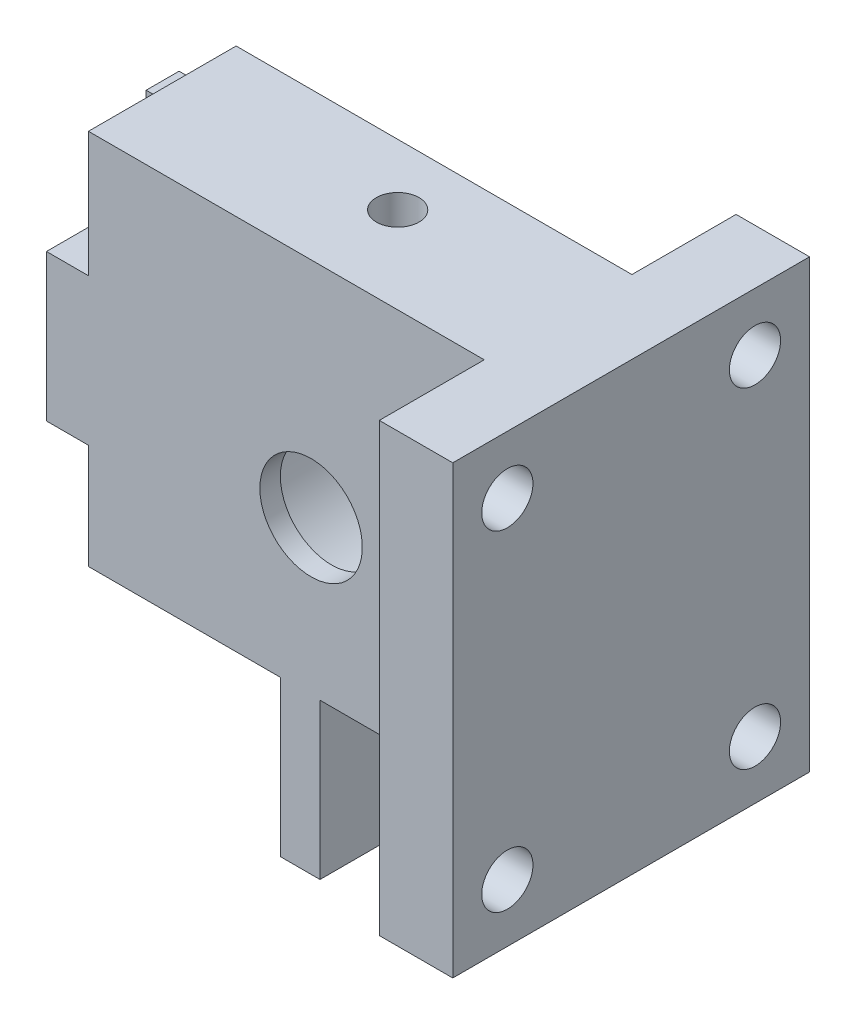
ISO-10303-21;
HEADER;
FILE_DESCRIPTION(('STEP AP214'),'2;1');
FILE_NAME('part.step','',(''),(''),'','','');
FILE_SCHEMA(('AUTOMOTIVE_DESIGN { 1 0 10303 214 1 1 1 1 }'));
ENDSEC;
DATA;
#1=APPLICATION_CONTEXT('core data for automotive mechanical design processes');
#2=APPLICATION_PROTOCOL_DEFINITION('international standard','automotive_design',2000,#1);
#3=PRODUCT_CONTEXT('',#1,'mechanical');
#4=PRODUCT('Part','Part','',(#3));
#5=PRODUCT_RELATED_PRODUCT_CATEGORY('part','',(#4));
#6=PRODUCT_DEFINITION_FORMATION('','',#4);
#7=PRODUCT_DEFINITION_CONTEXT('part definition',#1,'design');
#8=PRODUCT_DEFINITION('design','',#6,#7);
#9=PRODUCT_DEFINITION_SHAPE('','',#8);
#10=(LENGTH_UNIT() NAMED_UNIT(*) SI_UNIT(.MILLI.,.METRE.));
#11=(NAMED_UNIT(*) PLANE_ANGLE_UNIT() SI_UNIT($,.RADIAN.));
#12=(NAMED_UNIT(*) SI_UNIT($,.STERADIAN.) SOLID_ANGLE_UNIT());
#13=UNCERTAINTY_MEASURE_WITH_UNIT(LENGTH_MEASURE(1.E-05),#10,'distance_accuracy_value','');
#14=(GEOMETRIC_REPRESENTATION_CONTEXT(3) GLOBAL_UNCERTAINTY_ASSIGNED_CONTEXT((#13)) GLOBAL_UNIT_ASSIGNED_CONTEXT((#10,
#11,#12)) REPRESENTATION_CONTEXT('',''));
#15=CARTESIAN_POINT('',(0.,0.,0.));
#16=DIRECTION('',(0.,0.,1.));
#17=DIRECTION('',(1.,0.,0.));
#18=AXIS2_PLACEMENT_3D('',#15,#16,#17);
#19=CARTESIAN_POINT('',(32.385,-9.3091,21.59));
#20=DIRECTION('',(0.,1.,0.));
#21=DIRECTION('',(-1.,0.,0.));
#22=AXIS2_PLACEMENT_3D('',#19,#20,#21);
#23=PLANE('',#22);
#24=DIRECTION('',(0.,0.,1.));
#25=VECTOR('',#24,1.);
#26=CARTESIAN_POINT('',(11.9428,-9.3091,52.5553479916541));
#27=LINE('',#26,#25);
#28=CARTESIAN_POINT('',(11.9428,-9.3091,6.22294650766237));
#29=VERTEX_POINT('',#28);
#30=CARTESIAN_POINT('',(11.9428,-9.3091,15.24));
#31=VERTEX_POINT('',#30);
#32=EDGE_CURVE('E400',#29,#31,#27,.T.);
#33=ORIENTED_EDGE('',*,*,#32,.F.);
#34=DIRECTION('',(-1.,0.,0.));
#35=VECTOR('',#34,1.);
#36=CARTESIAN_POINT('',(53.1965963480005,-9.3091,6.22294650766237));
#37=LINE('',#36,#35);
#38=CARTESIAN_POINT('',(32.385,-9.3091,6.22294650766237));
#39=VERTEX_POINT('',#38);
#40=EDGE_CURVE('E307',#29,#39,#37,.F.);
#41=ORIENTED_EDGE('',*,*,#40,.T.);
#42=DIRECTION('',(0.,0.,-1.));
#43=VECTOR('',#42,1.);
#44=CARTESIAN_POINT('',(32.385,-9.3091,21.59));
#45=LINE('',#44,#43);
#46=CARTESIAN_POINT('',(32.385,-9.3091,15.24));
#47=VERTEX_POINT('',#46);
#48=EDGE_CURVE('E397',#47,#39,#45,.T.);
#49=ORIENTED_EDGE('',*,*,#48,.F.);
#50=DIRECTION('',(1.,0.,0.));
#51=VECTOR('',#50,1.);
#52=CARTESIAN_POINT('',(-3.41308724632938,-9.3091,15.24));
#53=LINE('',#52,#51);
#54=CARTESIAN_POINT('',(25.955625,-9.3091,15.24));
#55=VERTEX_POINT('',#54);
#56=EDGE_CURVE('E452',#55,#47,#53,.T.);
#57=ORIENTED_EDGE('',*,*,#56,.F.);
#58=DIRECTION('',(0.,0.,1.));
#59=VECTOR('',#58,1.);
#60=CARTESIAN_POINT('',(25.955625,-9.3091,15.24));
#61=LINE('',#60,#59);
#62=CARTESIAN_POINT('',(25.955625,-9.3091,6.35));
#63=VERTEX_POINT('',#62);
#64=EDGE_CURVE('E375',#63,#55,#61,.T.);
#65=ORIENTED_EDGE('',*,*,#64,.F.);
#66=DIRECTION('',(1.,0.,0.));
#67=VECTOR('',#66,1.);
#68=CARTESIAN_POINT('',(23.574375,-9.3091,6.35));
#69=LINE('',#68,#67);
#70=CARTESIAN_POINT('',(23.574375,-9.3091,6.35));
#71=VERTEX_POINT('',#70);
#72=EDGE_CURVE('E373',#71,#63,#69,.T.);
#73=ORIENTED_EDGE('',*,*,#72,.F.);
#74=DIRECTION('',(0.,0.,-1.));
#75=VECTOR('',#74,1.);
#76=CARTESIAN_POINT('',(23.574375,-9.3091,15.24));
#77=LINE('',#76,#75);
#78=CARTESIAN_POINT('',(23.574375,-9.3091,15.24));
#79=VERTEX_POINT('',#78);
#80=EDGE_CURVE('E370',#79,#71,#77,.T.);
#81=ORIENTED_EDGE('',*,*,#80,.F.);
#82=EDGE_CURVE('E453',#31,#79,#53,.T.);
#83=ORIENTED_EDGE('',*,*,#82,.F.);
#84=EDGE_LOOP('',(#33,#41,#49,#57,#65,#73,#81,#83));
#85=FACE_BOUND('',#84,.T.);
#86=ADVANCED_FACE('F41',(#85),#23,.F.);
#87=CARTESIAN_POINT('',(3.9672,13.5001,21.59));
#88=DIRECTION('',(1.,0.,0.));
#89=DIRECTION('',(0.,0.,-1.));
#90=AXIS2_PLACEMENT_3D('',#87,#88,#89);
#91=PLANE('',#90);
#92=DIRECTION('',(0.,0.,1.));
#93=VECTOR('',#92,1.);
#94=CARTESIAN_POINT('',(3.9672,-2.95402,21.59));
#95=LINE('',#94,#93);
#96=CARTESIAN_POINT('',(3.9672,-2.95402,1.778));
#97=VERTEX_POINT('',#96);
#98=CARTESIAN_POINT('',(3.9672,-2.95402,3.77094705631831));
#99=VERTEX_POINT('',#98);
#100=EDGE_CURVE('E350',#97,#99,#95,.T.);
#101=ORIENTED_EDGE('',*,*,#100,.T.);
#102=DIRECTION('',(0.,1.,0.));
#103=VECTOR('',#102,1.);
#104=CARTESIAN_POINT('',(3.9672,13.5001,3.77094705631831));
#105=LINE('',#104,#103);
#106=CARTESIAN_POINT('',(3.9672,5.9309,3.77094705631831));
#107=VERTEX_POINT('',#106);
#108=EDGE_CURVE('E339',#99,#107,#105,.T.);
#109=ORIENTED_EDGE('',*,*,#108,.T.);
#110=DIRECTION('',(0.,0.,-1.));
#111=VECTOR('',#110,1.);
#112=CARTESIAN_POINT('',(3.9672,5.9309,21.59));
#113=LINE('',#112,#111);
#114=CARTESIAN_POINT('',(3.9672,5.9309,1.778));
#115=VERTEX_POINT('',#114);
#116=EDGE_CURVE('E358',#107,#115,#113,.T.);
#117=ORIENTED_EDGE('',*,*,#116,.T.);
#118=DIRECTION('',(0.,-1.,0.));
#119=VECTOR('',#118,1.);
#120=CARTESIAN_POINT('',(3.9672,13.5001,1.778));
#121=LINE('',#120,#119);
#122=EDGE_CURVE('E427',#115,#97,#121,.T.);
#123=ORIENTED_EDGE('',*,*,#122,.T.);
#124=EDGE_LOOP('',(#101,#109,#117,#123));
#125=FACE_BOUND('',#124,.T.);
#126=ADVANCED_FACE('F43',(#125),#91,.F.);
#127=CARTESIAN_POINT('',(3.9672,-13.5001,21.59));
#128=DIRECTION('',(0.,1.,0.));
#129=DIRECTION('',(0.,0.,1.));
#130=AXIS2_PLACEMENT_3D('',#127,#128,#129);
#131=PLANE('',#130);
#132=DIRECTION('',(1.,0.,0.));
#133=VECTOR('',#132,1.);
#134=CARTESIAN_POINT('',(3.9672,-13.5001,6.3028084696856));
#135=LINE('',#134,#133);
#136=CARTESIAN_POINT('',(32.385,-13.5001,6.30280846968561));
#137=VERTEX_POINT('',#136);
#138=CARTESIAN_POINT('',(35.895,-13.5001,6.3028084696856));
#139=VERTEX_POINT('',#138);
#140=EDGE_CURVE('E310',#137,#139,#135,.T.);
#141=ORIENTED_EDGE('',*,*,#140,.T.);
#142=DIRECTION('',(0.,0.,-1.));
#143=VECTOR('',#142,1.);
#144=CARTESIAN_POINT('',(35.895,-13.5001,21.59));
#145=LINE('',#144,#143);
#146=CARTESIAN_POINT('',(35.895,-13.5001,0.));
#147=VERTEX_POINT('',#146);
#148=EDGE_CURVE('E304',#139,#147,#145,.T.);
#149=ORIENTED_EDGE('',*,*,#148,.T.);
#150=DIRECTION('',(1.,0.,0.));
#151=VECTOR('',#150,1.);
#152=CARTESIAN_POINT('',(3.9672,-13.5001,0.));
#153=LINE('',#152,#151);
#154=CARTESIAN_POINT('',(40.34,-13.5001,0.));
#155=VERTEX_POINT('',#154);
#156=EDGE_CURVE('E430',#147,#155,#153,.T.);
#157=ORIENTED_EDGE('',*,*,#156,.T.);
#158=DIRECTION('',(0.,0.,-1.));
#159=VECTOR('',#158,1.);
#160=CARTESIAN_POINT('',(40.34,-13.5001,21.59));
#161=LINE('',#160,#159);
#162=CARTESIAN_POINT('',(40.34,-13.5001,21.59));
#163=VERTEX_POINT('',#162);
#164=EDGE_CURVE('E447',#163,#155,#161,.T.);
#165=ORIENTED_EDGE('',*,*,#164,.F.);
#166=DIRECTION('',(1.,0.,0.));
#167=VECTOR('',#166,1.);
#168=CARTESIAN_POINT('',(3.9672,-13.5001,21.59));
#169=LINE('',#168,#167);
#170=CARTESIAN_POINT('',(35.895,-13.5001,21.59));
#171=VERTEX_POINT('',#170);
#172=EDGE_CURVE('E437',#171,#163,#169,.T.);
#173=ORIENTED_EDGE('',*,*,#172,.F.);
#174=DIRECTION('',(0.,0.,-1.));
#175=VECTOR('',#174,1.);
#176=CARTESIAN_POINT('',(35.895,-13.5001,28.8920472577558));
#177=LINE('',#176,#175);
#178=CARTESIAN_POINT('',(35.895,-13.5001,15.24));
#179=VERTEX_POINT('',#178);
#180=EDGE_CURVE('E410',#171,#179,#177,.T.);
#181=ORIENTED_EDGE('',*,*,#180,.T.);
#182=DIRECTION('',(-1.,0.,0.));
#183=VECTOR('',#182,1.);
#184=CARTESIAN_POINT('',(-3.41308724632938,-13.5001,15.24));
#185=LINE('',#184,#183);
#186=CARTESIAN_POINT('',(32.385,-13.5001,15.24));
#187=VERTEX_POINT('',#186);
#188=EDGE_CURVE('E413',#179,#187,#185,.T.);
#189=ORIENTED_EDGE('',*,*,#188,.T.);
#190=DIRECTION('',(0.,0.,-1.));
#191=VECTOR('',#190,1.);
#192=CARTESIAN_POINT('',(32.385,-13.5001,21.59));
#193=LINE('',#192,#191);
#194=EDGE_CURVE('E402',#187,#137,#193,.T.);
#195=ORIENTED_EDGE('',*,*,#194,.T.);
#196=EDGE_LOOP('',(#141,#149,#157,#165,#173,#181,#189,#195));
#197=FACE_BOUND('',#196,.T.);
#198=ADVANCED_FACE('F521',(#197),#131,.F.);
#199=CARTESIAN_POINT('',(40.34,13.5001,21.59));
#200=DIRECTION('',(-1.,0.,0.));
#201=DIRECTION('',(0.,0.,1.));
#202=AXIS2_PLACEMENT_3D('',#199,#200,#201);
#203=PLANE('',#202);
#204=CARTESIAN_POINT('',(40.34,9.9949,18.288));
#205=DIRECTION('',(1.,0.,0.));
#206=DIRECTION('',(0.,0.,-1.));
#207=AXIS2_PLACEMENT_3D('',#204,#205,#206);
#208=CIRCLE('',#207,1.54999999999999);
#209=CARTESIAN_POINT('',(40.34,9.9949,16.738));
#210=VERTEX_POINT('',#209);
#211=EDGE_CURVE('E316',#210,#210,#208,.T.);
#212=ORIENTED_EDGE('',*,*,#211,.F.);
#213=EDGE_LOOP('',(#212));
#214=FACE_BOUND('',#213,.T.);
#215=CARTESIAN_POINT('',(40.34,-9.9949,18.288));
#216=DIRECTION('',(1.,0.,0.));
#217=DIRECTION('',(0.,0.,-1.));
#218=AXIS2_PLACEMENT_3D('',#215,#216,#217);
#219=CIRCLE('',#218,1.54999999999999);
#220=CARTESIAN_POINT('',(40.34,-9.9949,16.738));
#221=VERTEX_POINT('',#220);
#222=EDGE_CURVE('E320',#221,#221,#219,.T.);
#223=ORIENTED_EDGE('',*,*,#222,.F.);
#224=EDGE_LOOP('',(#223));
#225=FACE_BOUND('',#224,.T.);
#226=CARTESIAN_POINT('',(40.34,9.9949,3.302));
#227=DIRECTION('',(1.,0.,0.));
#228=DIRECTION('',(0.,0.,-1.));
#229=AXIS2_PLACEMENT_3D('',#226,#227,#228);
#230=CIRCLE('',#229,1.54999999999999);
#231=CARTESIAN_POINT('',(40.34,9.9949,1.75200000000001));
#232=VERTEX_POINT('',#231);
#233=EDGE_CURVE('E324',#232,#232,#230,.T.);
#234=ORIENTED_EDGE('',*,*,#233,.F.);
#235=EDGE_LOOP('',(#234));
#236=FACE_BOUND('',#235,.T.);
#237=CARTESIAN_POINT('',(40.34,-9.9949,3.302));
#238=DIRECTION('',(1.,0.,0.));
#239=DIRECTION('',(0.,0.,-1.));
#240=AXIS2_PLACEMENT_3D('',#237,#238,#239);
#241=CIRCLE('',#240,1.54999999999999);
#242=CARTESIAN_POINT('',(40.34,-9.9949,1.75200000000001));
#243=VERTEX_POINT('',#242);
#244=EDGE_CURVE('E327',#243,#243,#241,.T.);
#245=ORIENTED_EDGE('',*,*,#244,.F.);
#246=EDGE_LOOP('',(#245));
#247=FACE_BOUND('',#246,.T.);
#248=DIRECTION('',(0.,1.,0.));
#249=VECTOR('',#248,1.);
#250=CARTESIAN_POINT('',(40.34,13.5001,0.));
#251=LINE('',#250,#249);
#252=CARTESIAN_POINT('',(40.34,13.5001,0.));
#253=VERTEX_POINT('',#252);
#254=EDGE_CURVE('E432',#155,#253,#251,.T.);
#255=ORIENTED_EDGE('',*,*,#254,.T.);
#256=DIRECTION('',(0.,0.,-1.));
#257=VECTOR('',#256,1.);
#258=CARTESIAN_POINT('',(40.34,13.5001,21.59));
#259=LINE('',#258,#257);
#260=CARTESIAN_POINT('',(40.34,13.5001,21.59));
#261=VERTEX_POINT('',#260);
#262=EDGE_CURVE('E444',#261,#253,#259,.T.);
#263=ORIENTED_EDGE('',*,*,#262,.F.);
#264=DIRECTION('',(0.,1.,0.));
#265=VECTOR('',#264,1.);
#266=CARTESIAN_POINT('',(40.34,13.5001,21.59));
#267=LINE('',#266,#265);
#268=EDGE_CURVE('E439',#163,#261,#267,.T.);
#269=ORIENTED_EDGE('',*,*,#268,.F.);
#270=ORIENTED_EDGE('',*,*,#164,.T.);
#271=EDGE_LOOP('',(#255,#263,#269,#270));
#272=FACE_BOUND('',#271,.T.);
#273=ADVANCED_FACE('F594',(#214,#225,#236,#247,#272),#203,.F.);
#274=CARTESIAN_POINT('',(3.9672,13.5001,21.59));
#275=DIRECTION('',(0.,-1.,0.));
#276=DIRECTION('',(0.,0.,-1.));
#277=AXIS2_PLACEMENT_3D('',#274,#275,#276);
#278=PLANE('',#277);
#279=CARTESIAN_POINT('',(25.4175,13.5001,10.));
#280=DIRECTION('',(0.,1.,0.));
#281=DIRECTION('',(0.,0.,1.));
#282=AXIS2_PLACEMENT_3D('',#279,#280,#281);
#283=CIRCLE('',#282,1.28905);
#284=CARTESIAN_POINT('',(25.4175,13.5001,11.28905));
#285=VERTEX_POINT('',#284);
#286=EDGE_CURVE('E917',#285,#285,#283,.T.);
#287=ORIENTED_EDGE('',*,*,#286,.F.);
#288=EDGE_LOOP('',(#287));
#289=FACE_BOUND('',#288,.T.);
#290=DIRECTION('',(-1.,0.,0.));
#291=VECTOR('',#290,1.);
#292=CARTESIAN_POINT('',(3.9672,13.5001,0.));
#293=LINE('',#292,#291);
#294=CARTESIAN_POINT('',(35.895,13.5001,0.));
#295=VERTEX_POINT('',#294);
#296=EDGE_CURVE('E434',#253,#295,#293,.T.);
#297=ORIENTED_EDGE('',*,*,#296,.T.);
#298=DIRECTION('',(0.,0.,1.));
#299=VECTOR('',#298,1.);
#300=CARTESIAN_POINT('',(35.895,13.5001,21.59));
#301=LINE('',#300,#299);
#302=CARTESIAN_POINT('',(35.895,13.5001,6.302375));
#303=VERTEX_POINT('',#302);
#304=EDGE_CURVE('E274',#295,#303,#301,.T.);
#305=ORIENTED_EDGE('',*,*,#304,.T.);
#306=DIRECTION('',(-1.,0.,0.));
#307=VECTOR('',#306,1.);
#308=CARTESIAN_POINT('',(3.9672,13.5001,6.302375));
#309=LINE('',#308,#307);
#310=CARTESIAN_POINT('',(11.9428,13.5001,6.302375));
#311=VERTEX_POINT('',#310);
#312=EDGE_CURVE('E277',#303,#311,#309,.T.);
#313=ORIENTED_EDGE('',*,*,#312,.T.);
#314=DIRECTION('',(0.,0.,-1.));
#315=VECTOR('',#314,1.);
#316=CARTESIAN_POINT('',(11.9428,13.5001,52.5553479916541));
#317=LINE('',#316,#315);
#318=CARTESIAN_POINT('',(11.9428,13.5001,15.24));
#319=VERTEX_POINT('',#318);
#320=EDGE_CURVE('E424',#319,#311,#317,.T.);
#321=ORIENTED_EDGE('',*,*,#320,.F.);
#322=DIRECTION('',(-1.,0.,0.));
#323=VECTOR('',#322,1.);
#324=CARTESIAN_POINT('',(-3.41308724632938,13.5001,15.24));
#325=LINE('',#324,#323);
#326=CARTESIAN_POINT('',(35.895,13.5001,15.24));
#327=VERTEX_POINT('',#326);
#328=EDGE_CURVE('E407',#327,#319,#325,.T.);
#329=ORIENTED_EDGE('',*,*,#328,.F.);
#330=DIRECTION('',(0.,0.,-1.));
#331=VECTOR('',#330,1.);
#332=CARTESIAN_POINT('',(35.895,13.5001,28.8920472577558));
#333=LINE('',#332,#331);
#334=CARTESIAN_POINT('',(35.895,13.5001,21.59));
#335=VERTEX_POINT('',#334);
#336=EDGE_CURVE('E405',#335,#327,#333,.T.);
#337=ORIENTED_EDGE('',*,*,#336,.F.);
#338=DIRECTION('',(-1.,0.,0.));
#339=VECTOR('',#338,1.);
#340=CARTESIAN_POINT('',(3.9672,13.5001,21.59));
#341=LINE('',#340,#339);
#342=EDGE_CURVE('E441',#261,#335,#341,.T.);
#343=ORIENTED_EDGE('',*,*,#342,.F.);
#344=ORIENTED_EDGE('',*,*,#262,.T.);
#345=EDGE_LOOP('',(#297,#305,#313,#321,#329,#337,#343,#344));
#346=FACE_BOUND('',#345,.T.);
#347=ADVANCED_FACE('F590',(#289,#346),#278,.F.);
#348=CARTESIAN_POINT('',(3.9672,-13.5001,21.59));
#349=DIRECTION('',(0.,0.,1.));
#350=DIRECTION('',(1.,0.,0.));
#351=AXIS2_PLACEMENT_3D('',#348,#349,#350);
#352=PLANE('',#351);
#353=DIRECTION('',(0.,1.,0.));
#354=VECTOR('',#353,1.);
#355=CARTESIAN_POINT('',(35.895,-13.5001,21.59));
#356=LINE('',#355,#354);
#357=EDGE_CURVE('E450',#171,#335,#356,.T.);
#358=ORIENTED_EDGE('',*,*,#357,.F.);
#359=ORIENTED_EDGE('',*,*,#172,.T.);
#360=ORIENTED_EDGE('',*,*,#268,.T.);
#361=ORIENTED_EDGE('',*,*,#342,.T.);
#362=EDGE_LOOP('',(#358,#359,#360,#361));
#363=FACE_BOUND('',#362,.T.);
#364=ADVANCED_FACE('F586',(#363),#352,.T.);
#365=CARTESIAN_POINT('',(3.9672,-13.5001,0.));
#366=DIRECTION('',(0.,0.,1.));
#367=DIRECTION('',(1.,0.,0.));
#368=AXIS2_PLACEMENT_3D('',#365,#366,#367);
#369=PLANE('',#368);
#370=CARTESIAN_POINT('',(25.4175,-0.0127000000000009,0.));
#371=DIRECTION('',(0.,0.,-1.));
#372=DIRECTION('',(-1.,0.,0.));
#373=AXIS2_PLACEMENT_3D('',#370,#371,#372);
#374=CIRCLE('',#373,6.);
#375=CARTESIAN_POINT('',(19.4175,-0.0127000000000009,0.));
#376=VERTEX_POINT('',#375);
#377=EDGE_CURVE('E364',#376,#376,#374,.T.);
#378=ORIENTED_EDGE('',*,*,#377,.F.);
#379=EDGE_LOOP('',(#378));
#380=FACE_BOUND('',#379,.T.);
#381=DIRECTION('',(1.,0.,0.));
#382=VECTOR('',#381,1.);
#383=CARTESIAN_POINT('',(3.96720000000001,6.994525,0.));
#384=LINE('',#383,#382);
#385=CARTESIAN_POINT('',(11.9428,6.994525,0.));
#386=VERTEX_POINT('',#385);
#387=CARTESIAN_POINT('',(35.895,6.994525,0.));
#388=VERTEX_POINT('',#387);
#389=EDGE_CURVE('E280',#386,#388,#384,.T.);
#390=ORIENTED_EDGE('',*,*,#389,.T.);
#391=DIRECTION('',(0.,1.,0.));
#392=VECTOR('',#391,1.);
#393=CARTESIAN_POINT('',(35.895,-13.5001,0.));
#394=LINE('',#393,#392);
#395=EDGE_CURVE('E271',#388,#295,#394,.T.);
#396=ORIENTED_EDGE('',*,*,#395,.T.);
#397=ORIENTED_EDGE('',*,*,#296,.F.);
#398=ORIENTED_EDGE('',*,*,#254,.F.);
#399=ORIENTED_EDGE('',*,*,#156,.F.);
#400=DIRECTION('',(0.,1.,0.));
#401=VECTOR('',#400,1.);
#402=CARTESIAN_POINT('',(35.895,-13.5001,0.));
#403=LINE('',#402,#401);
#404=CARTESIAN_POINT('',(35.895,-6.994525,0.));
#405=VERTEX_POINT('',#404);
#406=EDGE_CURVE('E301',#147,#405,#403,.T.);
#407=ORIENTED_EDGE('',*,*,#406,.T.);
#408=DIRECTION('',(-1.,0.,0.));
#409=VECTOR('',#408,1.);
#410=CARTESIAN_POINT('',(3.9672,-6.994525,0.));
#411=LINE('',#410,#409);
#412=CARTESIAN_POINT('',(11.9428,-6.994525,0.));
#413=VERTEX_POINT('',#412);
#414=EDGE_CURVE('E313',#405,#413,#411,.T.);
#415=ORIENTED_EDGE('',*,*,#414,.T.);
#416=DIRECTION('',(0.,-1.,0.));
#417=VECTOR('',#416,1.);
#418=CARTESIAN_POINT('',(11.9428,13.5001,0.));
#419=LINE('',#418,#417);
#420=EDGE_CURVE('E419',#386,#413,#419,.T.);
#421=ORIENTED_EDGE('',*,*,#420,.F.);
#422=EDGE_LOOP('',(#390,#396,#397,#398,#399,#407,#415,#421));
#423=FACE_BOUND('',#422,.T.);
#424=ADVANCED_FACE('F506',(#380,#423),#369,.F.);
#425=CARTESIAN_POINT('',(3.9672,-13.5001,1.778));
#426=DIRECTION('',(0.,0.,1.));
#427=DIRECTION('',(1.,0.,0.));
#428=AXIS2_PLACEMENT_3D('',#425,#426,#427);
#429=PLANE('',#428);
#430=CARTESIAN_POINT('',(6.685,1.4859,1.778));
#431=DIRECTION('',(0.,0.,-1.));
#432=DIRECTION('',(-1.,0.,0.));
#433=AXIS2_PLACEMENT_3D('',#430,#431,#432);
#434=CIRCLE('',#433,1.45);
#435=CARTESIAN_POINT('',(5.23500000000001,1.4859,1.778));
#436=VERTEX_POINT('',#435);
#437=EDGE_CURVE('E244',#436,#436,#434,.T.);
#438=ORIENTED_EDGE('',*,*,#437,.F.);
#439=EDGE_LOOP('',(#438));
#440=FACE_BOUND('',#439,.T.);
#441=DIRECTION('',(0.,-1.,0.));
#442=VECTOR('',#441,1.);
#443=CARTESIAN_POINT('',(11.9428,13.5001,1.778));
#444=LINE('',#443,#442);
#445=CARTESIAN_POINT('',(11.9428,5.9309,1.778));
#446=VERTEX_POINT('',#445);
#447=CARTESIAN_POINT('',(11.9428,-2.95402,1.778));
#448=VERTEX_POINT('',#447);
#449=EDGE_CURVE('E421',#446,#448,#444,.T.);
#450=ORIENTED_EDGE('',*,*,#449,.T.);
#451=DIRECTION('',(1.,0.,0.));
#452=VECTOR('',#451,1.);
#453=CARTESIAN_POINT('',(11.9428,-2.95402,1.778));
#454=LINE('',#453,#452);
#455=EDGE_CURVE('E345',#97,#448,#454,.T.);
#456=ORIENTED_EDGE('',*,*,#455,.F.);
#457=ORIENTED_EDGE('',*,*,#122,.F.);
#458=DIRECTION('',(-1.,0.,0.));
#459=VECTOR('',#458,1.);
#460=CARTESIAN_POINT('',(11.9428,5.9309,1.778));
#461=LINE('',#460,#459);
#462=EDGE_CURVE('E353',#446,#115,#461,.T.);
#463=ORIENTED_EDGE('',*,*,#462,.F.);
#464=EDGE_LOOP('',(#450,#456,#457,#463));
#465=FACE_BOUND('',#464,.T.);
#466=ADVANCED_FACE('F579',(#440,#465),#429,.F.);
#467=CARTESIAN_POINT('',(11.9428,13.5001,52.5553479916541));
#468=DIRECTION('',(1.,0.,0.));
#469=DIRECTION('',(0.,1.,0.));
#470=AXIS2_PLACEMENT_3D('',#467,#468,#469);
#471=PLANE('',#470);
#472=CARTESIAN_POINT('',(11.9428,9.6901,10.795));
#473=DIRECTION('',(-1.,0.,0.));
#474=DIRECTION('',(0.,0.,1.));
#475=AXIS2_PLACEMENT_3D('',#472,#473,#474);
#476=CIRCLE('',#475,1.28905);
#477=CARTESIAN_POINT('',(11.9428,9.6901,12.08405));
#478=VERTEX_POINT('',#477);
#479=EDGE_CURVE('E237',#478,#478,#476,.T.);
#480=ORIENTED_EDGE('',*,*,#479,.F.);
#481=EDGE_LOOP('',(#480));
#482=FACE_BOUND('',#481,.T.);
#483=CARTESIAN_POINT('',(11.9428,-6.1341,10.795));
#484=DIRECTION('',(-1.,0.,0.));
#485=DIRECTION('',(0.,0.,1.));
#486=AXIS2_PLACEMENT_3D('',#483,#484,#485);
#487=CIRCLE('',#486,1.28905);
#488=CARTESIAN_POINT('',(11.9428,-6.1341,12.08405));
#489=VERTEX_POINT('',#488);
#490=EDGE_CURVE('E250',#489,#489,#487,.T.);
#491=ORIENTED_EDGE('',*,*,#490,.F.);
#492=EDGE_LOOP('',(#491));
#493=FACE_BOUND('',#492,.T.);
#494=CARTESIAN_POINT('',(11.9428,9.9949,3.302));
#495=DIRECTION('',(-1.,0.,0.));
#496=DIRECTION('',(0.,-1.,0.));
#497=AXIS2_PLACEMENT_3D('',#494,#495,#496);
#498=CIRCLE('',#497,3.000375);
#499=CARTESIAN_POINT('',(11.9428,6.994525,3.302));
#500=VERTEX_POINT('',#499);
#501=CARTESIAN_POINT('',(11.9428,9.9949,6.302375));
#502=VERTEX_POINT('',#501);
#503=EDGE_CURVE('E62',#500,#502,#498,.T.);
#504=ORIENTED_EDGE('',*,*,#503,.F.);
#505=DIRECTION('',(0.,0.,1.));
#506=VECTOR('',#505,1.);
#507=CARTESIAN_POINT('',(11.9428,6.994525,3.302));
#508=LINE('',#507,#506);
#509=EDGE_CURVE('E253',#386,#500,#508,.T.);
#510=ORIENTED_EDGE('',*,*,#509,.F.);
#511=ORIENTED_EDGE('',*,*,#420,.T.);
#512=DIRECTION('',(0.,0.,-1.));
#513=VECTOR('',#512,1.);
#514=CARTESIAN_POINT('',(11.9428,-6.994525,3.302));
#515=LINE('',#514,#513);
#516=CARTESIAN_POINT('',(11.9428,-6.994525,3.302));
#517=VERTEX_POINT('',#516);
#518=EDGE_CURVE('E284',#517,#413,#515,.T.);
#519=ORIENTED_EDGE('',*,*,#518,.F.);
#520=CARTESIAN_POINT('',(11.9428,-9.9949,3.302));
#521=DIRECTION('',(-1.,0.,0.));
#522=DIRECTION('',(0.,-1.,0.));
#523=AXIS2_PLACEMENT_3D('',#520,#521,#522);
#524=CIRCLE('',#523,3.000375);
#525=EDGE_CURVE('E283',#29,#517,#524,.T.);
#526=ORIENTED_EDGE('',*,*,#525,.F.);
#527=ORIENTED_EDGE('',*,*,#32,.T.);
#528=DIRECTION('',(0.,-1.,0.));
#529=VECTOR('',#528,1.);
#530=CARTESIAN_POINT('',(11.9428,-13.5001,15.24));
#531=LINE('',#530,#529);
#532=CARTESIAN_POINT('',(11.9428,-2.95402,15.24));
#533=VERTEX_POINT('',#532);
#534=EDGE_CURVE('E468',#533,#31,#531,.T.);
#535=ORIENTED_EDGE('',*,*,#534,.F.);
#536=DIRECTION('',(0.,0.,-1.));
#537=VECTOR('',#536,1.);
#538=CARTESIAN_POINT('',(11.9428,-2.95402,21.59));
#539=LINE('',#538,#537);
#540=EDGE_CURVE('E348',#533,#448,#539,.T.);
#541=ORIENTED_EDGE('',*,*,#540,.T.);
#542=ORIENTED_EDGE('',*,*,#449,.F.);
#543=DIRECTION('',(0.,0.,-1.));
#544=VECTOR('',#543,1.);
#545=CARTESIAN_POINT('',(11.9428,5.9309,21.59));
#546=LINE('',#545,#544);
#547=CARTESIAN_POINT('',(11.9428,5.9309,15.24));
#548=VERTEX_POINT('',#547);
#549=EDGE_CURVE('E356',#548,#446,#546,.T.);
#550=ORIENTED_EDGE('',*,*,#549,.F.);
#551=DIRECTION('',(0.,-1.,0.));
#552=VECTOR('',#551,1.);
#553=CARTESIAN_POINT('',(11.9428,-13.5001,15.24));
#554=LINE('',#553,#552);
#555=EDGE_CURVE('E463',#319,#548,#554,.T.);
#556=ORIENTED_EDGE('',*,*,#555,.F.);
#557=ORIENTED_EDGE('',*,*,#320,.T.);
#558=DIRECTION('',(0.,1.,0.));
#559=VECTOR('',#558,1.);
#560=CARTESIAN_POINT('',(11.9428,9.9949,6.302375));
#561=LINE('',#560,#559);
#562=EDGE_CURVE('E254',#502,#311,#561,.T.);
#563=ORIENTED_EDGE('',*,*,#562,.F.);
#564=EDGE_LOOP('',(#504,#510,#511,#519,#526,#527,#535,#541,#542,#550,#556,#557,#563));
#565=FACE_BOUND('',#564,.T.);
#566=ADVANCED_FACE('F509',(#482,#493,#565),#471,.F.);
#567=CARTESIAN_POINT('',(-3.41308724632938,-13.5001,15.24));
#568=DIRECTION('',(0.,0.,-1.));
#569=DIRECTION('',(-1.,0.,0.));
#570=AXIS2_PLACEMENT_3D('',#567,#568,#569);
#571=PLANE('',#570);
#572=CARTESIAN_POINT('',(25.4175,-0.0127000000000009,15.24));
#573=DIRECTION('',(0.,0.,-1.));
#574=DIRECTION('',(-1.,0.,0.));
#575=AXIS2_PLACEMENT_3D('',#572,#573,#574);
#576=CIRCLE('',#575,3.09999999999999);
#577=CARTESIAN_POINT('',(22.3175,-0.0127000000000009,15.24));
#578=VERTEX_POINT('',#577);
#579=EDGE_CURVE('E361',#578,#578,#576,.T.);
#580=ORIENTED_EDGE('',*,*,#579,.T.);
#581=EDGE_LOOP('',(#580));
#582=FACE_BOUND('',#581,.T.);
#583=DIRECTION('',(-1.,0.,0.));
#584=VECTOR('',#583,1.);
#585=CARTESIAN_POINT('',(-3.41308724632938,5.9309,15.24));
#586=LINE('',#585,#584);
#587=CARTESIAN_POINT('',(9.4028,5.9309,15.24));
#588=VERTEX_POINT('',#587);
#589=EDGE_CURVE('E458',#548,#588,#586,.T.);
#590=ORIENTED_EDGE('',*,*,#589,.T.);
#591=DIRECTION('',(0.,-1.,0.));
#592=VECTOR('',#591,1.);
#593=CARTESIAN_POINT('',(9.4028,-13.5001,15.24));
#594=LINE('',#593,#592);
#595=CARTESIAN_POINT('',(9.4028,-2.95402,15.24));
#596=VERTEX_POINT('',#595);
#597=EDGE_CURVE('E333',#588,#596,#594,.T.);
#598=ORIENTED_EDGE('',*,*,#597,.T.);
#599=DIRECTION('',(1.,0.,0.));
#600=VECTOR('',#599,1.);
#601=CARTESIAN_POINT('',(-3.41308724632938,-2.95402,15.24));
#602=LINE('',#601,#600);
#603=EDGE_CURVE('E466',#596,#533,#602,.T.);
#604=ORIENTED_EDGE('',*,*,#603,.T.);
#605=ORIENTED_EDGE('',*,*,#534,.T.);
#606=ORIENTED_EDGE('',*,*,#82,.T.);
#607=DIRECTION('',(0.,1.,0.));
#608=VECTOR('',#607,1.);
#609=CARTESIAN_POINT('',(23.574375,-18.7071,15.24));
#610=LINE('',#609,#608);
#611=CARTESIAN_POINT('',(23.574375,-18.7071,15.24));
#612=VERTEX_POINT('',#611);
#613=EDGE_CURVE('E387',#612,#79,#610,.T.);
#614=ORIENTED_EDGE('',*,*,#613,.F.);
#615=DIRECTION('',(-1.,0.,0.));
#616=VECTOR('',#615,1.);
#617=CARTESIAN_POINT('',(23.574375,-18.7071,15.24));
#618=LINE('',#617,#616);
#619=CARTESIAN_POINT('',(25.955625,-18.7071,15.24));
#620=VERTEX_POINT('',#619);
#621=EDGE_CURVE('E385',#620,#612,#618,.T.);
#622=ORIENTED_EDGE('',*,*,#621,.F.);
#623=DIRECTION('',(0.,1.,0.));
#624=VECTOR('',#623,1.);
#625=CARTESIAN_POINT('',(25.955625,-18.7071,15.24));
#626=LINE('',#625,#624);
#627=EDGE_CURVE('E390',#620,#55,#626,.T.);
#628=ORIENTED_EDGE('',*,*,#627,.T.);
#629=ORIENTED_EDGE('',*,*,#56,.T.);
#630=DIRECTION('',(0.,-1.,0.));
#631=VECTOR('',#630,1.);
#632=CARTESIAN_POINT('',(32.385,-13.5001,15.24));
#633=LINE('',#632,#631);
#634=EDGE_CURVE('E455',#47,#187,#633,.T.);
#635=ORIENTED_EDGE('',*,*,#634,.T.);
#636=ORIENTED_EDGE('',*,*,#188,.F.);
#637=DIRECTION('',(0.,1.,0.));
#638=VECTOR('',#637,1.);
#639=CARTESIAN_POINT('',(35.895,-13.5001,15.24));
#640=LINE('',#639,#638);
#641=EDGE_CURVE('E416',#179,#327,#640,.T.);
#642=ORIENTED_EDGE('',*,*,#641,.T.);
#643=ORIENTED_EDGE('',*,*,#328,.T.);
#644=ORIENTED_EDGE('',*,*,#555,.T.);
#645=EDGE_LOOP('',(#590,#598,#604,#605,#606,#614,#622,#628,#629,#635,#636,#642,#643,#644));
#646=FACE_BOUND('',#645,.T.);
#647=ADVANCED_FACE('F528',(#582,#646),#571,.F.);
#648=CARTESIAN_POINT('',(35.895,-13.5001,28.8920472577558));
#649=DIRECTION('',(1.,0.,0.));
#650=DIRECTION('',(0.,0.,-1.));
#651=AXIS2_PLACEMENT_3D('',#648,#649,#650);
#652=PLANE('',#651);
#653=CARTESIAN_POINT('',(35.895,9.9949,18.288));
#654=DIRECTION('',(1.,0.,0.));
#655=DIRECTION('',(0.,0.,-1.));
#656=AXIS2_PLACEMENT_3D('',#653,#654,#655);
#657=CIRCLE('',#656,1.54999999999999);
#658=CARTESIAN_POINT('',(35.895,9.9949,16.738));
#659=VERTEX_POINT('',#658);
#660=EDGE_CURVE('E319',#659,#659,#657,.T.);
#661=ORIENTED_EDGE('',*,*,#660,.T.);
#662=EDGE_LOOP('',(#661));
#663=FACE_BOUND('',#662,.T.);
#664=CARTESIAN_POINT('',(35.895,-9.9949,18.288));
#665=DIRECTION('',(1.,0.,0.));
#666=DIRECTION('',(0.,0.,-1.));
#667=AXIS2_PLACEMENT_3D('',#664,#665,#666);
#668=CIRCLE('',#667,1.54999999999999);
#669=CARTESIAN_POINT('',(35.895,-9.9949,16.738));
#670=VERTEX_POINT('',#669);
#671=EDGE_CURVE('E323',#670,#670,#668,.T.);
#672=ORIENTED_EDGE('',*,*,#671,.T.);
#673=EDGE_LOOP('',(#672));
#674=FACE_BOUND('',#673,.T.);
#675=ORIENTED_EDGE('',*,*,#357,.T.);
#676=ORIENTED_EDGE('',*,*,#336,.T.);
#677=ORIENTED_EDGE('',*,*,#641,.F.);
#678=ORIENTED_EDGE('',*,*,#180,.F.);
#679=EDGE_LOOP('',(#675,#676,#677,#678));
#680=FACE_BOUND('',#679,.T.);
#681=ADVANCED_FACE('F570',(#663,#674,#680),#652,.F.);
#682=CARTESIAN_POINT('',(32.385,-9.3091,21.59));
#683=DIRECTION('',(1.,0.,0.));
#684=DIRECTION('',(0.,0.,-1.));
#685=AXIS2_PLACEMENT_3D('',#682,#683,#684);
#686=PLANE('',#685);
#687=CARTESIAN_POINT('',(32.385,-9.9949,3.302));
#688=DIRECTION('',(1.,0.,0.));
#689=DIRECTION('',(0.,0.,-1.));
#690=AXIS2_PLACEMENT_3D('',#687,#688,#689);
#691=CIRCLE('',#690,3.000375);
#692=CARTESIAN_POINT('',(32.385,-9.99452897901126,6.3023749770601));
#693=VERTEX_POINT('',#692);
#694=EDGE_CURVE('E54',#39,#693,#691,.T.);
#695=ORIENTED_EDGE('',*,*,#694,.T.);
#696=DIRECTION('',(0.,-0.999999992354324,0.000123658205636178));
#697=VECTOR('',#696,1.);
#698=CARTESIAN_POINT('',(32.385,-9.31099045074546,6.30229045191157));
#699=LINE('',#698,#697);
#700=EDGE_CURVE('E13',#693,#137,#699,.T.);
#701=ORIENTED_EDGE('',*,*,#700,.T.);
#702=ORIENTED_EDGE('',*,*,#194,.F.);
#703=ORIENTED_EDGE('',*,*,#634,.F.);
#704=ORIENTED_EDGE('',*,*,#48,.T.);
#705=EDGE_LOOP('',(#695,#701,#702,#703,#704));
#706=FACE_BOUND('',#705,.T.);
#707=ADVANCED_FACE('F526',(#706),#686,.F.);
#708=CARTESIAN_POINT('',(23.574375,-18.7071,15.24));
#709=DIRECTION('',(1.,0.,0.));
#710=DIRECTION('',(0.,1.,0.));
#711=AXIS2_PLACEMENT_3D('',#708,#709,#710);
#712=PLANE('',#711);
#713=ORIENTED_EDGE('',*,*,#80,.T.);
#714=DIRECTION('',(0.,1.,0.));
#715=VECTOR('',#714,1.);
#716=CARTESIAN_POINT('',(23.574375,-18.7071,6.35));
#717=LINE('',#716,#715);
#718=CARTESIAN_POINT('',(23.574375,-18.7071,6.35));
#719=VERTEX_POINT('',#718);
#720=EDGE_CURVE('E395',#719,#71,#717,.T.);
#721=ORIENTED_EDGE('',*,*,#720,.F.);
#722=DIRECTION('',(0.,0.,-1.));
#723=VECTOR('',#722,1.);
#724=CARTESIAN_POINT('',(23.574375,-18.7071,15.24));
#725=LINE('',#724,#723);
#726=EDGE_CURVE('E378',#612,#719,#725,.T.);
#727=ORIENTED_EDGE('',*,*,#726,.F.);
#728=ORIENTED_EDGE('',*,*,#613,.T.);
#729=EDGE_LOOP('',(#713,#721,#727,#728));
#730=FACE_BOUND('',#729,.T.);
#731=ADVANCED_FACE('F543',(#730),#712,.F.);
#732=CARTESIAN_POINT('',(23.574375,-18.7071,6.35));
#733=DIRECTION('',(0.,0.,1.));
#734=DIRECTION('',(1.,0.,0.));
#735=AXIS2_PLACEMENT_3D('',#732,#733,#734);
#736=PLANE('',#735);
#737=ORIENTED_EDGE('',*,*,#72,.T.);
#738=DIRECTION('',(0.,1.,0.));
#739=VECTOR('',#738,1.);
#740=CARTESIAN_POINT('',(25.955625,-18.7071,6.35));
#741=LINE('',#740,#739);
#742=CARTESIAN_POINT('',(25.955625,-18.7071,6.35));
#743=VERTEX_POINT('',#742);
#744=EDGE_CURVE('E392',#743,#63,#741,.T.);
#745=ORIENTED_EDGE('',*,*,#744,.F.);
#746=DIRECTION('',(1.,0.,0.));
#747=VECTOR('',#746,1.);
#748=CARTESIAN_POINT('',(23.574375,-18.7071,6.35));
#749=LINE('',#748,#747);
#750=EDGE_CURVE('E381',#719,#743,#749,.T.);
#751=ORIENTED_EDGE('',*,*,#750,.F.);
#752=ORIENTED_EDGE('',*,*,#720,.T.);
#753=EDGE_LOOP('',(#737,#745,#751,#752));
#754=FACE_BOUND('',#753,.T.);
#755=ADVANCED_FACE('F552',(#754),#736,.F.);
#756=CARTESIAN_POINT('',(25.955625,-18.7071,15.24));
#757=DIRECTION('',(-1.,0.,0.));
#758=DIRECTION('',(0.,0.,1.));
#759=AXIS2_PLACEMENT_3D('',#756,#757,#758);
#760=PLANE('',#759);
#761=ORIENTED_EDGE('',*,*,#64,.T.);
#762=ORIENTED_EDGE('',*,*,#627,.F.);
#763=DIRECTION('',(0.,0.,1.));
#764=VECTOR('',#763,1.);
#765=CARTESIAN_POINT('',(25.955625,-18.7071,15.24));
#766=LINE('',#765,#764);
#767=EDGE_CURVE('E383',#743,#620,#766,.T.);
#768=ORIENTED_EDGE('',*,*,#767,.F.);
#769=ORIENTED_EDGE('',*,*,#744,.T.);
#770=EDGE_LOOP('',(#761,#762,#768,#769));
#771=FACE_BOUND('',#770,.T.);
#772=ADVANCED_FACE('F550',(#771),#760,.F.);
#773=CARTESIAN_POINT('',(23.574375,-18.7071,6.35));
#774=DIRECTION('',(0.,-1.,0.));
#775=DIRECTION('',(0.,0.,-1.));
#776=AXIS2_PLACEMENT_3D('',#773,#774,#775);
#777=PLANE('',#776);
#778=ORIENTED_EDGE('',*,*,#726,.T.);
#779=ORIENTED_EDGE('',*,*,#750,.T.);
#780=ORIENTED_EDGE('',*,*,#767,.T.);
#781=ORIENTED_EDGE('',*,*,#621,.T.);
#782=EDGE_LOOP('',(#778,#779,#780,#781));
#783=FACE_BOUND('',#782,.T.);
#784=ADVANCED_FACE('F546',(#783),#777,.T.);
#785=CARTESIAN_POINT('',(25.4175,-0.0127000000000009,14.));
#786=DIRECTION('',(0.,0.,-1.));
#787=DIRECTION('',(-1.,0.,0.));
#788=AXIS2_PLACEMENT_3D('',#785,#786,#787);
#789=CYLINDRICAL_SURFACE('',#788,6.);
#790=CARTESIAN_POINT('',(25.4175,5.9873,11.28905));
#791=CARTESIAN_POINT('',(25.4890256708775,5.98729867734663,11.2890475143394));
#792=CARTESIAN_POINT('',(25.5605816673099,5.98600799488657,11.2830767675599));
#793=CARTESIAN_POINT('',(25.7016632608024,5.98098383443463,11.2593750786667));
#794=CARTESIAN_POINT('',(25.7711873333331,5.97724856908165,11.241635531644));
#795=CARTESIAN_POINT('',(25.9061455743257,5.96775139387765,11.1949758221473));
#796=CARTESIAN_POINT('',(25.9715838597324,5.96199156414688,11.1660671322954));
#797=CARTESIAN_POINT('',(26.0966785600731,5.94906786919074,11.0979256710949));
#798=CARTESIAN_POINT('',(26.1563351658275,5.94190405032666,11.0586932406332));
#799=CARTESIAN_POINT('',(26.2691012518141,5.92683369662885,10.9703736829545));
#800=CARTESIAN_POINT('',(26.3221081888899,5.91891822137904,10.9211571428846));
#801=CARTESIAN_POINT('',(26.4191813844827,5.90330010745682,10.8145443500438));
#802=CARTESIAN_POINT('',(26.4632468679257,5.89559748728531,10.7571473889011));
#803=CARTESIAN_POINT('',(26.5416353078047,5.88118924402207,10.6350492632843));
#804=CARTESIAN_POINT('',(26.5758497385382,5.87449508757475,10.5702769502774));
#805=CARTESIAN_POINT('',(26.6328689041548,5.86298975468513,10.4357346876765));
#806=CARTESIAN_POINT('',(26.6556749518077,5.85817836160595,10.365965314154));
#807=CARTESIAN_POINT('',(26.688892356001,5.85107424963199,10.2245198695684));
#808=CARTESIAN_POINT('',(26.6994849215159,5.84874474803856,10.1528882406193));
#809=CARTESIAN_POINT('',(26.7085379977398,5.84675765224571,10.0088296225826));
#810=CARTESIAN_POINT('',(26.7069999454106,5.84709974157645,9.9364027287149));
#811=CARTESIAN_POINT('',(26.6919814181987,5.85038384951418,9.79415203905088));
#812=CARTESIAN_POINT('',(26.6787108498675,5.8532801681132,9.72430486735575));
#813=CARTESIAN_POINT('',(26.640936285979,5.86127420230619,9.58785196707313));
#814=CARTESIAN_POINT('',(26.6164316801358,5.86637203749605,9.52124641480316));
#815=CARTESIAN_POINT('',(26.5566902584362,5.87824010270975,9.39257417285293));
#816=CARTESIAN_POINT('',(26.5213721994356,5.88502291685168,9.33054641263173));
#817=CARTESIAN_POINT('',(26.441063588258,5.89948889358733,9.21321989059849));
#818=CARTESIAN_POINT('',(26.3960717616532,5.90717217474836,9.15792201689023));
#819=CARTESIAN_POINT('',(26.2965788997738,5.922769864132,9.05441588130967));
#820=CARTESIAN_POINT('',(26.2418992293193,5.93068575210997,9.00637938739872));
#821=CARTESIAN_POINT('',(26.1251713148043,5.9457107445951,8.92013093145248));
#822=CARTESIAN_POINT('',(26.0631229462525,5.95281983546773,8.88191913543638));
#823=CARTESIAN_POINT('',(25.9332133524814,5.9654520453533,8.81636462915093));
#824=CARTESIAN_POINT('',(25.8653407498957,5.97097196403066,8.78904380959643));
#825=CARTESIAN_POINT('',(25.7258233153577,5.97978000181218,8.74624210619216));
#826=CARTESIAN_POINT('',(25.6541790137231,5.98306843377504,8.73075956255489));
#827=CARTESIAN_POINT('',(25.5106258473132,5.9869986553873,8.71232230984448));
#828=CARTESIAN_POINT('',(25.4387484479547,5.98769002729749,8.70913287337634));
#829=CARTESIAN_POINT('',(25.2954878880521,5.98648691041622,8.7147370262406));
#830=CARTESIAN_POINT('',(25.2241046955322,5.98459259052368,8.72352983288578));
#831=CARTESIAN_POINT('',(25.0846321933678,5.97846217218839,8.75265414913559));
#832=CARTESIAN_POINT('',(25.0165161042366,5.97425095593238,8.77286311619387));
#833=CARTESIAN_POINT('',(24.8846402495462,5.96395786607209,8.82411053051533));
#834=CARTESIAN_POINT('',(24.82088084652,5.95787583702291,8.85514987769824));
#835=CARTESIAN_POINT('',(24.6985535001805,5.94439316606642,8.92767002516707));
#836=CARTESIAN_POINT('',(24.6400696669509,5.93697543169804,8.96928945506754));
#837=CARTESIAN_POINT('',(24.530831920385,5.9216801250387,9.06160514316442));
#838=CARTESIAN_POINT('',(24.4800789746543,5.91380249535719,9.1123025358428));
#839=CARTESIAN_POINT('',(24.3868203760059,5.89830487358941,9.22241039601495));
#840=CARTESIAN_POINT('',(24.344476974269,5.89069192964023,9.28195945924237));
#841=CARTESIAN_POINT('',(24.2703916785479,5.87674559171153,9.40746188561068));
#842=CARTESIAN_POINT('',(24.2386493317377,5.87041214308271,9.47341497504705));
#843=CARTESIAN_POINT('',(24.1868776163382,5.85980096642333,9.60950302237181));
#844=CARTESIAN_POINT('',(24.1667833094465,5.85551186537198,9.67961234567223));
#845=CARTESIAN_POINT('',(24.1386862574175,5.84945367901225,9.82231597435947));
#846=CARTESIAN_POINT('',(24.1306816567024,5.84768420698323,9.89490989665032));
#847=CARTESIAN_POINT('',(24.1270680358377,5.84688938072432,10.0388876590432));
#848=CARTESIAN_POINT('',(24.1312019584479,5.84780711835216,10.1102648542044));
#849=CARTESIAN_POINT('',(24.1511749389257,5.85215493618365,10.2512803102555));
#850=CARTESIAN_POINT('',(24.1670138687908,5.85558498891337,10.320918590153));
#851=CARTESIAN_POINT('',(24.2098250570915,5.86454369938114,10.4562839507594));
#852=CARTESIAN_POINT('',(24.2367611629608,5.87006553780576,10.5220229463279));
#853=CARTESIAN_POINT('',(24.3009705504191,5.8825885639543,10.6480873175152));
#854=CARTESIAN_POINT('',(24.3382448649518,5.88958989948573,10.7084121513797));
#855=CARTESIAN_POINT('',(24.4229306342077,5.90445392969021,10.8232057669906));
#856=CARTESIAN_POINT('',(24.4705258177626,5.91233077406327,10.8775372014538));
#857=CARTESIAN_POINT('',(24.5741283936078,5.92796187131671,10.9775265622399));
#858=CARTESIAN_POINT('',(24.630137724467,5.9357160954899,11.0231824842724));
#859=CARTESIAN_POINT('',(24.7498165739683,5.95034235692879,11.1050661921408));
#860=CARTESIAN_POINT('',(24.8135725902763,5.95720224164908,11.1411698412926));
#861=CARTESIAN_POINT('',(24.9463808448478,5.96914553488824,11.2020916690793));
#862=CARTESIAN_POINT('',(25.0154285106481,5.97423045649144,11.2269194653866));
#863=CARTESIAN_POINT('',(25.1400536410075,5.98112620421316,11.2600771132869));
#864=CARTESIAN_POINT('',(25.1949489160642,5.98342720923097,11.270921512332));
#865=CARTESIAN_POINT('',(25.3057233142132,5.98651459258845,11.2854087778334));
#866=CARTESIAN_POINT('',(25.3616023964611,5.987301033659,11.2890519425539));
#867=CARTESIAN_POINT('',(25.4175,5.9873,11.28905));
#868=B_SPLINE_CURVE_WITH_KNOTS('',3,(#790,#791,#792,#793,#794,#795,#796,#797,#798,#799,#800,
#801,#802,#803,#804,#805,#806,#807,#808,#809,#810,#811,#812,#813,#814,#815,#816,#817,#818,#819,
#820,#821,#822,#823,#824,#825,#826,#827,#828,#829,#830,#831,#832,#833,#834,#835,#836,#837,#838,
#839,#840,#841,#842,#843,#844,#845,#846,#847,#848,#849,#850,#851,#852,#853,#854,#855,#856,#857,
#858,#859,#860,#861,#862,#863,#864,#865,#866,#867),.UNSPECIFIED.,.T.,.F.,(4,2,2,2,2,2,2,2,2,2,2,
2,2,2,2,2,2,2,2,2,2,2,2,2,2,2,2,2,2,2,2,2,2,2,2,2,2,2,4),(0.,0.21437243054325,0.428901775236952,
0.643211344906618,0.857513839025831,1.07479544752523,1.29209588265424,1.51170588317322,
1.73129060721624,1.94757368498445,2.16383114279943,2.37629610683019,2.58877261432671,
2.80288638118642,3.01702837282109,3.23563318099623,3.4542416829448,3.67328739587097,
3.89230239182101,4.10711412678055,4.32191183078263,4.53444652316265,4.7469988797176,
4.96249441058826,5.17801689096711,5.39736213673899,5.6166980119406,5.83479901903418,
6.05286654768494,6.26634959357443,6.47983030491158,6.6926209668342,6.90543289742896,
7.12240025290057,7.33941767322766,7.55913037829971,7.77865532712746,7.94619519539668,
8.11372812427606),.UNSPECIFIED.);
#869=CARTESIAN_POINT('',(25.4175,5.9873,11.28905));
#870=VERTEX_POINT('',#869);
#871=EDGE_CURVE('E45',#870,#870,#868,.T.);
#872=ORIENTED_EDGE('',*,*,#871,.T.);
#873=EDGE_LOOP('',(#872));
#874=FACE_BOUND('',#873,.T.);
#875=CARTESIAN_POINT('',(25.4175,-0.0127000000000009,14.));
#876=DIRECTION('',(0.,0.,-1.));
#877=DIRECTION('',(-1.,0.,0.));
#878=AXIS2_PLACEMENT_3D('',#875,#876,#877);
#879=CIRCLE('',#878,6.);
#880=CARTESIAN_POINT('',(19.4175,-0.0127000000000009,14.));
#881=VERTEX_POINT('',#880);
#882=EDGE_CURVE('E367',#881,#881,#879,.T.);
#883=ORIENTED_EDGE('',*,*,#882,.F.);
#884=EDGE_LOOP('',(#883));
#885=FACE_BOUND('',#884,.T.);
#886=ORIENTED_EDGE('',*,*,#377,.T.);
#887=EDGE_LOOP('',(#886));
#888=FACE_BOUND('',#887,.T.);
#889=ADVANCED_FACE('F672',(#874,#885,#888),#789,.F.);
#890=CARTESIAN_POINT('',(25.4175,-0.0127000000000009,14.));
#891=DIRECTION('',(0.,0.,-1.));
#892=DIRECTION('',(-1.,0.,0.));
#893=AXIS2_PLACEMENT_3D('',#890,#891,#892);
#894=PLANE('',#893);
#895=CARTESIAN_POINT('',(25.4175,-0.0127000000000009,14.));
#896=DIRECTION('',(0.,0.,-1.));
#897=DIRECTION('',(-1.,0.,0.));
#898=AXIS2_PLACEMENT_3D('',#895,#896,#897);
#899=CIRCLE('',#898,3.09999999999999);
#900=CARTESIAN_POINT('',(22.3175,-0.0127000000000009,14.));
#901=VERTEX_POINT('',#900);
#902=EDGE_CURVE('E360',#901,#901,#899,.T.);
#903=ORIENTED_EDGE('',*,*,#902,.F.);
#904=EDGE_LOOP('',(#903));
#905=FACE_BOUND('',#904,.T.);
#906=ORIENTED_EDGE('',*,*,#882,.T.);
#907=EDGE_LOOP('',(#906));
#908=FACE_BOUND('',#907,.T.);
#909=ADVANCED_FACE('F679',(#905,#908),#894,.T.);
#910=CARTESIAN_POINT('',(25.4175,-0.0127000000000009,0.));
#911=DIRECTION('',(0.,0.,-1.));
#912=DIRECTION('',(-1.,0.,0.));
#913=AXIS2_PLACEMENT_3D('',#910,#911,#912);
#914=CYLINDRICAL_SURFACE('',#913,3.09999999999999);
#915=ORIENTED_EDGE('',*,*,#902,.T.);
#916=EDGE_LOOP('',(#915));
#917=FACE_BOUND('',#916,.T.);
#918=ORIENTED_EDGE('',*,*,#579,.F.);
#919=EDGE_LOOP('',(#918));
#920=FACE_BOUND('',#919,.T.);
#921=ADVANCED_FACE('F684',(#917,#920),#914,.F.);
#922=CARTESIAN_POINT('',(11.9428,5.9309,21.59));
#923=DIRECTION('',(0.,-1.,0.));
#924=DIRECTION('',(0.,0.,-1.));
#925=AXIS2_PLACEMENT_3D('',#922,#923,#924);
#926=PLANE('',#925);
#927=ORIENTED_EDGE('',*,*,#116,.F.);
#928=DIRECTION('',(1.,0.,0.));
#929=VECTOR('',#928,1.);
#930=CARTESIAN_POINT('',(11.9428,5.9309,3.77094705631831));
#931=LINE('',#930,#929);
#932=CARTESIAN_POINT('',(9.4028,5.9309,3.77094705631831));
#933=VERTEX_POINT('',#932);
#934=EDGE_CURVE('E342',#107,#933,#931,.T.);
#935=ORIENTED_EDGE('',*,*,#934,.T.);
#936=DIRECTION('',(0.,0.,1.));
#937=VECTOR('',#936,1.);
#938=CARTESIAN_POINT('',(9.4028,5.9309,21.59));
#939=LINE('',#938,#937);
#940=EDGE_CURVE('E336',#933,#588,#939,.T.);
#941=ORIENTED_EDGE('',*,*,#940,.T.);
#942=ORIENTED_EDGE('',*,*,#589,.F.);
#943=ORIENTED_EDGE('',*,*,#549,.T.);
#944=ORIENTED_EDGE('',*,*,#462,.T.);
#945=EDGE_LOOP('',(#927,#935,#941,#942,#943,#944));
#946=FACE_BOUND('',#945,.T.);
#947=ADVANCED_FACE('F693',(#946),#926,.F.);
#948=CARTESIAN_POINT('',(11.9428,-2.95402,21.59));
#949=DIRECTION('',(0.,1.,0.));
#950=DIRECTION('',(0.,0.,1.));
#951=AXIS2_PLACEMENT_3D('',#948,#949,#950);
#952=PLANE('',#951);
#953=DIRECTION('',(0.,0.,-1.));
#954=VECTOR('',#953,1.);
#955=CARTESIAN_POINT('',(9.4028,-2.95402,21.59));
#956=LINE('',#955,#954);
#957=CARTESIAN_POINT('',(9.4028,-2.95402,3.77094705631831));
#958=VERTEX_POINT('',#957);
#959=EDGE_CURVE('E471',#596,#958,#956,.T.);
#960=ORIENTED_EDGE('',*,*,#959,.T.);
#961=DIRECTION('',(-1.,0.,0.));
#962=VECTOR('',#961,1.);
#963=CARTESIAN_POINT('',(11.9428,-2.95402,3.77094705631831));
#964=LINE('',#963,#962);
#965=EDGE_CURVE('E474',#958,#99,#964,.T.);
#966=ORIENTED_EDGE('',*,*,#965,.T.);
#967=ORIENTED_EDGE('',*,*,#100,.F.);
#968=ORIENTED_EDGE('',*,*,#455,.T.);
#969=ORIENTED_EDGE('',*,*,#540,.F.);
#970=ORIENTED_EDGE('',*,*,#603,.F.);
#971=EDGE_LOOP('',(#960,#966,#967,#968,#969,#970));
#972=FACE_BOUND('',#971,.T.);
#973=ADVANCED_FACE('F737',(#972),#952,.F.);
#974=CARTESIAN_POINT('',(2.22218663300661,-18.7071,3.77094705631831));
#975=DIRECTION('',(0.,0.,-1.));
#976=DIRECTION('',(-1.,0.,0.));
#977=AXIS2_PLACEMENT_3D('',#974,#975,#976);
#978=PLANE('',#977);
#979=CARTESIAN_POINT('',(6.685,1.4859,3.77094705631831));
#980=DIRECTION('',(0.,0.,-1.));
#981=DIRECTION('',(-1.,0.,0.));
#982=AXIS2_PLACEMENT_3D('',#979,#980,#981);
#983=CIRCLE('',#982,1.45);
#984=CARTESIAN_POINT('',(5.23500000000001,1.4859,3.77094705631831));
#985=VERTEX_POINT('',#984);
#986=EDGE_CURVE('E238',#985,#985,#983,.T.);
#987=ORIENTED_EDGE('',*,*,#986,.T.);
#988=EDGE_LOOP('',(#987));
#989=FACE_BOUND('',#988,.T.);
#990=ORIENTED_EDGE('',*,*,#108,.F.);
#991=ORIENTED_EDGE('',*,*,#965,.F.);
#992=DIRECTION('',(0.,1.,0.));
#993=VECTOR('',#992,1.);
#994=CARTESIAN_POINT('',(9.4028,-18.7071,3.77094705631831));
#995=LINE('',#994,#993);
#996=EDGE_CURVE('E330',#958,#933,#995,.T.);
#997=ORIENTED_EDGE('',*,*,#996,.T.);
#998=ORIENTED_EDGE('',*,*,#934,.F.);
#999=EDGE_LOOP('',(#990,#991,#997,#998));
#1000=FACE_BOUND('',#999,.T.);
#1001=ADVANCED_FACE('F746',(#989,#1000),#978,.F.);
#1002=CARTESIAN_POINT('',(9.4028,-18.7071,16.002));
#1003=DIRECTION('',(1.,0.,0.));
#1004=DIRECTION('',(0.,0.,-1.));
#1005=AXIS2_PLACEMENT_3D('',#1002,#1003,#1004);
#1006=PLANE('',#1005);
#1007=ORIENTED_EDGE('',*,*,#996,.F.);
#1008=ORIENTED_EDGE('',*,*,#959,.F.);
#1009=ORIENTED_EDGE('',*,*,#597,.F.);
#1010=ORIENTED_EDGE('',*,*,#940,.F.);
#1011=EDGE_LOOP('',(#1007,#1008,#1009,#1010));
#1012=FACE_BOUND('',#1011,.T.);
#1013=ADVANCED_FACE('F754',(#1012),#1006,.F.);
#1014=CARTESIAN_POINT('',(40.34,-9.9949,3.302));
#1015=DIRECTION('',(1.,0.,0.));
#1016=DIRECTION('',(0.,0.,-1.));
#1017=AXIS2_PLACEMENT_3D('',#1014,#1015,#1016);
#1018=CYLINDRICAL_SURFACE('',#1017,1.54999999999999);
#1019=CARTESIAN_POINT('',(35.895,-9.9949,3.302));
#1020=DIRECTION('',(1.,0.,0.));
#1021=DIRECTION('',(0.,0.,-1.));
#1022=AXIS2_PLACEMENT_3D('',#1019,#1020,#1021);
#1023=CIRCLE('',#1022,1.54999999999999);
#1024=CARTESIAN_POINT('',(35.895,-9.9949,1.75200000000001));
#1025=VERTEX_POINT('',#1024);
#1026=EDGE_CURVE('E292',#1025,#1025,#1023,.F.);
#1027=ORIENTED_EDGE('',*,*,#1026,.T.);
#1028=EDGE_LOOP('',(#1027));
#1029=FACE_BOUND('',#1028,.T.);
#1030=ORIENTED_EDGE('',*,*,#244,.T.);
#1031=EDGE_LOOP('',(#1030));
#1032=FACE_BOUND('',#1031,.T.);
#1033=ADVANCED_FACE('F762',(#1029,#1032),#1018,.F.);
#1034=CARTESIAN_POINT('',(40.34,9.9949,3.302));
#1035=DIRECTION('',(1.,0.,0.));
#1036=DIRECTION('',(0.,0.,-1.));
#1037=AXIS2_PLACEMENT_3D('',#1034,#1035,#1036);
#1038=CYLINDRICAL_SURFACE('',#1037,1.54999999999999);
#1039=CARTESIAN_POINT('',(35.895,9.9949,3.302));
#1040=DIRECTION('',(1.,0.,0.));
#1041=DIRECTION('',(0.,0.,-1.));
#1042=AXIS2_PLACEMENT_3D('',#1039,#1040,#1041);
#1043=CIRCLE('',#1042,1.54999999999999);
#1044=CARTESIAN_POINT('',(35.895,9.9949,1.75200000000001));
#1045=VERTEX_POINT('',#1044);
#1046=EDGE_CURVE('E264',#1045,#1045,#1043,.F.);
#1047=ORIENTED_EDGE('',*,*,#1046,.T.);
#1048=EDGE_LOOP('',(#1047));
#1049=FACE_BOUND('',#1048,.T.);
#1050=ORIENTED_EDGE('',*,*,#233,.T.);
#1051=EDGE_LOOP('',(#1050));
#1052=FACE_BOUND('',#1051,.T.);
#1053=ADVANCED_FACE('F488',(#1049,#1052),#1038,.F.);
#1054=CARTESIAN_POINT('',(40.34,-9.9949,18.288));
#1055=DIRECTION('',(1.,0.,0.));
#1056=DIRECTION('',(0.,0.,-1.));
#1057=AXIS2_PLACEMENT_3D('',#1054,#1055,#1056);
#1058=CYLINDRICAL_SURFACE('',#1057,1.54999999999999);
#1059=ORIENTED_EDGE('',*,*,#222,.T.);
#1060=EDGE_LOOP('',(#1059));
#1061=FACE_BOUND('',#1060,.T.);
#1062=ORIENTED_EDGE('',*,*,#671,.F.);
#1063=EDGE_LOOP('',(#1062));
#1064=FACE_BOUND('',#1063,.T.);
#1065=ADVANCED_FACE('F783',(#1061,#1064),#1058,.F.);
#1066=CARTESIAN_POINT('',(40.34,9.9949,18.288));
#1067=DIRECTION('',(1.,0.,0.));
#1068=DIRECTION('',(0.,0.,-1.));
#1069=AXIS2_PLACEMENT_3D('',#1066,#1067,#1068);
#1070=CYLINDRICAL_SURFACE('',#1069,1.54999999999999);
#1071=ORIENTED_EDGE('',*,*,#211,.T.);
#1072=EDGE_LOOP('',(#1071));
#1073=FACE_BOUND('',#1072,.T.);
#1074=ORIENTED_EDGE('',*,*,#660,.F.);
#1075=EDGE_LOOP('',(#1074));
#1076=FACE_BOUND('',#1075,.T.);
#1077=ADVANCED_FACE('F791',(#1073,#1076),#1070,.F.);
#1078=CARTESIAN_POINT('',(53.1965963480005,-6.994525,3.302));
#1079=DIRECTION('',(0.,1.,0.));
#1080=DIRECTION('',(0.,0.,1.));
#1081=AXIS2_PLACEMENT_3D('',#1078,#1079,#1080);
#1082=PLANE('',#1081);
#1083=DIRECTION('',(0.,0.,-1.));
#1084=VECTOR('',#1083,1.);
#1085=CARTESIAN_POINT('',(35.895,-6.994525,3.302));
#1086=LINE('',#1085,#1084);
#1087=CARTESIAN_POINT('',(35.895,-6.994525,3.302));
#1088=VERTEX_POINT('',#1087);
#1089=EDGE_CURVE('E289',#1088,#405,#1086,.T.);
#1090=ORIENTED_EDGE('',*,*,#1089,.F.);
#1091=DIRECTION('',(-1.,0.,0.));
#1092=VECTOR('',#1091,1.);
#1093=CARTESIAN_POINT('',(53.1965963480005,-6.994525,3.302));
#1094=LINE('',#1093,#1092);
#1095=EDGE_CURVE('E293',#1088,#517,#1094,.T.);
#1096=ORIENTED_EDGE('',*,*,#1095,.T.);
#1097=ORIENTED_EDGE('',*,*,#518,.T.);
#1098=ORIENTED_EDGE('',*,*,#414,.F.);
#1099=EDGE_LOOP('',(#1090,#1096,#1097,#1098));
#1100=FACE_BOUND('',#1099,.T.);
#1101=ADVANCED_FACE('F512',(#1100),#1082,.F.);
#1102=CARTESIAN_POINT('',(53.1965963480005,-9.99452897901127,6.3023749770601));
#1103=DIRECTION('',(0.,0.000123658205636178,0.999999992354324));
#1104=DIRECTION('',(0.,-0.999999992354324,0.000123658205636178));
#1105=AXIS2_PLACEMENT_3D('',#1102,#1103,#1104);
#1106=PLANE('',#1105);
#1107=ORIENTED_EDGE('',*,*,#700,.F.);
#1108=DIRECTION('',(-1.,0.,0.));
#1109=VECTOR('',#1108,1.);
#1110=CARTESIAN_POINT('',(53.1965963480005,-9.99452897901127,6.3023749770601));
#1111=LINE('',#1110,#1109);
#1112=CARTESIAN_POINT('',(35.895,-9.99452897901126,6.3023749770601));
#1113=VERTEX_POINT('',#1112);
#1114=EDGE_CURVE('E70',#1113,#693,#1111,.T.);
#1115=ORIENTED_EDGE('',*,*,#1114,.F.);
#1116=DIRECTION('',(0.,0.999999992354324,-0.000123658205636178));
#1117=VECTOR('',#1116,1.);
#1118=CARTESIAN_POINT('',(35.895,-9.99452897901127,6.3023749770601));
#1119=LINE('',#1118,#1117);
#1120=EDGE_CURVE('E287',#139,#1113,#1119,.T.);
#1121=ORIENTED_EDGE('',*,*,#1120,.F.);
#1122=ORIENTED_EDGE('',*,*,#140,.F.);
#1123=EDGE_LOOP('',(#1107,#1115,#1121,#1122));
#1124=FACE_BOUND('',#1123,.T.);
#1125=ADVANCED_FACE('F519',(#1124),#1106,.F.);
#1126=CARTESIAN_POINT('',(53.1965963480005,-9.9949,3.302));
#1127=DIRECTION('',(-1.,0.,0.));
#1128=DIRECTION('',(0.,-1.,0.));
#1129=AXIS2_PLACEMENT_3D('',#1126,#1127,#1128);
#1130=CYLINDRICAL_SURFACE('',#1129,3.000375);
#1131=ORIENTED_EDGE('',*,*,#525,.T.);
#1132=ORIENTED_EDGE('',*,*,#1095,.F.);
#1133=CARTESIAN_POINT('',(35.895,-9.9949,3.302));
#1134=DIRECTION('',(1.,0.,0.));
#1135=DIRECTION('',(0.,0.,-1.));
#1136=AXIS2_PLACEMENT_3D('',#1133,#1134,#1135);
#1137=CIRCLE('',#1136,3.000375);
#1138=EDGE_CURVE('E294',#1113,#1088,#1137,.F.);
#1139=ORIENTED_EDGE('',*,*,#1138,.F.);
#1140=ORIENTED_EDGE('',*,*,#1114,.T.);
#1141=ORIENTED_EDGE('',*,*,#694,.F.);
#1142=ORIENTED_EDGE('',*,*,#40,.F.);
#1143=EDGE_LOOP('',(#1131,#1132,#1139,#1140,#1141,#1142));
#1144=FACE_BOUND('',#1143,.T.);
#1145=ADVANCED_FACE('F514',(#1144),#1130,.F.);
#1146=CARTESIAN_POINT('',(35.895,-13.5001,28.8920472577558));
#1147=DIRECTION('',(1.,0.,0.));
#1148=DIRECTION('',(0.,0.,-1.));
#1149=AXIS2_PLACEMENT_3D('',#1146,#1147,#1148);
#1150=PLANE('',#1149);
#1151=ORIENTED_EDGE('',*,*,#1026,.F.);
#1152=EDGE_LOOP('',(#1151));
#1153=FACE_BOUND('',#1152,.T.);
#1154=ORIENTED_EDGE('',*,*,#1120,.T.);
#1155=ORIENTED_EDGE('',*,*,#1138,.T.);
#1156=ORIENTED_EDGE('',*,*,#1089,.T.);
#1157=ORIENTED_EDGE('',*,*,#406,.F.);
#1158=ORIENTED_EDGE('',*,*,#148,.F.);
#1159=EDGE_LOOP('',(#1154,#1155,#1156,#1157,#1158));
#1160=FACE_BOUND('',#1159,.T.);
#1161=ADVANCED_FACE('F516',(#1153,#1160),#1150,.F.);
#1162=CARTESIAN_POINT('',(53.1965963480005,6.99452499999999,3.302));
#1163=DIRECTION('',(0.,-1.,0.));
#1164=DIRECTION('',(0.,0.,-1.));
#1165=AXIS2_PLACEMENT_3D('',#1162,#1163,#1164);
#1166=PLANE('',#1165);
#1167=ORIENTED_EDGE('',*,*,#509,.T.);
#1168=DIRECTION('',(-1.,0.,0.));
#1169=VECTOR('',#1168,1.);
#1170=CARTESIAN_POINT('',(53.1965963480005,6.99452499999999,3.302));
#1171=LINE('',#1170,#1169);
#1172=CARTESIAN_POINT('',(35.895,6.994525,3.302));
#1173=VERTEX_POINT('',#1172);
#1174=EDGE_CURVE('E260',#1173,#500,#1171,.T.);
#1175=ORIENTED_EDGE('',*,*,#1174,.F.);
#1176=DIRECTION('',(0.,0.,1.));
#1177=VECTOR('',#1176,1.);
#1178=CARTESIAN_POINT('',(35.895,6.994525,3.302));
#1179=LINE('',#1178,#1177);
#1180=EDGE_CURVE('E256',#388,#1173,#1179,.T.);
#1181=ORIENTED_EDGE('',*,*,#1180,.F.);
#1182=ORIENTED_EDGE('',*,*,#389,.F.);
#1183=EDGE_LOOP('',(#1167,#1175,#1181,#1182));
#1184=FACE_BOUND('',#1183,.T.);
#1185=ADVANCED_FACE('F503',(#1184),#1166,.F.);
#1186=CARTESIAN_POINT('',(53.1965963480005,9.99489999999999,6.302375));
#1187=DIRECTION('',(0.,0.,1.));
#1188=DIRECTION('',(1.,0.,0.));
#1189=AXIS2_PLACEMENT_3D('',#1186,#1187,#1188);
#1190=PLANE('',#1189);
#1191=DIRECTION('',(0.,1.,0.));
#1192=VECTOR('',#1191,1.);
#1193=CARTESIAN_POINT('',(35.895,9.99489999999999,6.302375));
#1194=LINE('',#1193,#1192);
#1195=CARTESIAN_POINT('',(35.895,9.9949,6.302375));
#1196=VERTEX_POINT('',#1195);
#1197=EDGE_CURVE('E261',#1196,#303,#1194,.T.);
#1198=ORIENTED_EDGE('',*,*,#1197,.F.);
#1199=DIRECTION('',(-1.,0.,0.));
#1200=VECTOR('',#1199,1.);
#1201=CARTESIAN_POINT('',(53.1965963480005,9.99489999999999,6.302375));
#1202=LINE('',#1201,#1200);
#1203=EDGE_CURVE('E265',#1196,#502,#1202,.T.);
#1204=ORIENTED_EDGE('',*,*,#1203,.T.);
#1205=ORIENTED_EDGE('',*,*,#562,.T.);
#1206=ORIENTED_EDGE('',*,*,#312,.F.);
#1207=EDGE_LOOP('',(#1198,#1204,#1205,#1206));
#1208=FACE_BOUND('',#1207,.T.);
#1209=ADVANCED_FACE('F495',(#1208),#1190,.F.);
#1210=CARTESIAN_POINT('',(35.895,-13.5001,28.8920472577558));
#1211=DIRECTION('',(1.,0.,0.));
#1212=DIRECTION('',(0.,0.,-1.));
#1213=AXIS2_PLACEMENT_3D('',#1210,#1211,#1212);
#1214=PLANE('',#1213);
#1215=ORIENTED_EDGE('',*,*,#1046,.F.);
#1216=EDGE_LOOP('',(#1215));
#1217=FACE_BOUND('',#1216,.T.);
#1218=ORIENTED_EDGE('',*,*,#395,.F.);
#1219=ORIENTED_EDGE('',*,*,#1180,.T.);
#1220=CARTESIAN_POINT('',(35.895,9.9949,3.302));
#1221=DIRECTION('',(1.,0.,0.));
#1222=DIRECTION('',(0.,0.,-1.));
#1223=AXIS2_PLACEMENT_3D('',#1220,#1221,#1222);
#1224=CIRCLE('',#1223,3.000375);
#1225=EDGE_CURVE('E266',#1173,#1196,#1224,.F.);
#1226=ORIENTED_EDGE('',*,*,#1225,.T.);
#1227=ORIENTED_EDGE('',*,*,#1197,.T.);
#1228=ORIENTED_EDGE('',*,*,#304,.F.);
#1229=EDGE_LOOP('',(#1218,#1219,#1226,#1227,#1228));
#1230=FACE_BOUND('',#1229,.T.);
#1231=ADVANCED_FACE('F491',(#1217,#1230),#1214,.F.);
#1232=CARTESIAN_POINT('',(53.1965963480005,9.99489999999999,3.302));
#1233=DIRECTION('',(-1.,0.,0.));
#1234=DIRECTION('',(0.,-1.,0.));
#1235=AXIS2_PLACEMENT_3D('',#1232,#1233,#1234);
#1236=CYLINDRICAL_SURFACE('',#1235,3.000375);
#1237=ORIENTED_EDGE('',*,*,#1174,.T.);
#1238=ORIENTED_EDGE('',*,*,#503,.T.);
#1239=ORIENTED_EDGE('',*,*,#1203,.F.);
#1240=ORIENTED_EDGE('',*,*,#1225,.F.);
#1241=EDGE_LOOP('',(#1237,#1238,#1239,#1240));
#1242=FACE_BOUND('',#1241,.T.);
#1243=ADVANCED_FACE('F494',(#1242),#1236,.F.);
#1244=CARTESIAN_POINT('',(11.9428,-6.1341,10.795));
#1245=DIRECTION('',(-1.,0.,0.));
#1246=DIRECTION('',(0.,0.,1.));
#1247=AXIS2_PLACEMENT_3D('',#1244,#1245,#1246);
#1248=CYLINDRICAL_SURFACE('',#1247,1.28905);
#1249=CARTESIAN_POINT('',(17.099,-6.1341,10.795));
#1250=DIRECTION('',(-1.,0.,0.));
#1251=DIRECTION('',(0.,0.,1.));
#1252=AXIS2_PLACEMENT_3D('',#1249,#1250,#1251);
#1253=CIRCLE('',#1252,1.28905);
#1254=CARTESIAN_POINT('',(17.099,-6.1341,12.08405));
#1255=VERTEX_POINT('',#1254);
#1256=EDGE_CURVE('E241',#1255,#1255,#1253,.T.);
#1257=ORIENTED_EDGE('',*,*,#1256,.F.);
#1258=EDGE_LOOP('',(#1257));
#1259=FACE_BOUND('',#1258,.T.);
#1260=ORIENTED_EDGE('',*,*,#490,.T.);
#1261=EDGE_LOOP('',(#1260));
#1262=FACE_BOUND('',#1261,.T.);
#1263=ADVANCED_FACE('F854',(#1259,#1262),#1248,.F.);
#1264=CARTESIAN_POINT('',(17.099,-6.1341,10.795));
#1265=DIRECTION('',(-1.,0.,0.));
#1266=DIRECTION('',(0.,0.,1.));
#1267=AXIS2_PLACEMENT_3D('',#1264,#1265,#1266);
#1268=CONICAL_SURFACE('',#1267,1.28905,1.02974425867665);
#1269=CARTESIAN_POINT('',(17.8735393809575,-6.1341,10.795));
#1270=VERTEX_POINT('',#1269);
#1271=VERTEX_LOOP('',#1270);
#1272=FACE_BOUND('',#1271,.T.);
#1273=ORIENTED_EDGE('',*,*,#1256,.T.);
#1274=EDGE_LOOP('',(#1273));
#1275=FACE_BOUND('',#1274,.T.);
#1276=ADVANCED_FACE('F861',(#1272,#1275),#1268,.F.);
#1277=CARTESIAN_POINT('',(11.9428,9.6901,10.795));
#1278=DIRECTION('',(-1.,0.,0.));
#1279=DIRECTION('',(0.,0.,1.));
#1280=AXIS2_PLACEMENT_3D('',#1277,#1278,#1279);
#1281=CYLINDRICAL_SURFACE('',#1280,1.28905);
#1282=CARTESIAN_POINT('',(17.099,9.6901,10.795));
#1283=DIRECTION('',(-1.,0.,0.));
#1284=DIRECTION('',(0.,0.,1.));
#1285=AXIS2_PLACEMENT_3D('',#1282,#1283,#1284);
#1286=CIRCLE('',#1285,1.28905);
#1287=CARTESIAN_POINT('',(17.099,9.6901,12.08405));
#1288=VERTEX_POINT('',#1287);
#1289=EDGE_CURVE('E235',#1288,#1288,#1286,.T.);
#1290=ORIENTED_EDGE('',*,*,#1289,.F.);
#1291=EDGE_LOOP('',(#1290));
#1292=FACE_BOUND('',#1291,.T.);
#1293=ORIENTED_EDGE('',*,*,#479,.T.);
#1294=EDGE_LOOP('',(#1293));
#1295=FACE_BOUND('',#1294,.T.);
#1296=ADVANCED_FACE('F231',(#1292,#1295),#1281,.F.);
#1297=CARTESIAN_POINT('',(17.099,9.6901,10.795));
#1298=DIRECTION('',(-1.,0.,0.));
#1299=DIRECTION('',(0.,0.,1.));
#1300=AXIS2_PLACEMENT_3D('',#1297,#1298,#1299);
#1301=CONICAL_SURFACE('',#1300,1.28905,1.02974425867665);
#1302=CARTESIAN_POINT('',(17.8735393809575,9.6901,10.795));
#1303=VERTEX_POINT('',#1302);
#1304=VERTEX_LOOP('',#1303);
#1305=FACE_BOUND('',#1304,.T.);
#1306=ORIENTED_EDGE('',*,*,#1289,.T.);
#1307=EDGE_LOOP('',(#1306));
#1308=FACE_BOUND('',#1307,.T.);
#1309=ADVANCED_FACE('F227',(#1305,#1308),#1301,.F.);
#1310=CARTESIAN_POINT('',(6.685,1.4859,1.778));
#1311=DIRECTION('',(0.,0.,-1.));
#1312=DIRECTION('',(-1.,0.,0.));
#1313=AXIS2_PLACEMENT_3D('',#1310,#1311,#1312);
#1314=CYLINDRICAL_SURFACE('',#1313,1.45);
#1315=ORIENTED_EDGE('',*,*,#437,.T.);
#1316=EDGE_LOOP('',(#1315));
#1317=FACE_BOUND('',#1316,.T.);
#1318=ORIENTED_EDGE('',*,*,#986,.F.);
#1319=EDGE_LOOP('',(#1318));
#1320=FACE_BOUND('',#1319,.T.);
#1321=ADVANCED_FACE('F230',(#1317,#1320),#1314,.F.);
#1322=CARTESIAN_POINT('',(25.4175,13.5001,10.));
#1323=DIRECTION('',(0.,1.,0.));
#1324=DIRECTION('',(0.,0.,1.));
#1325=AXIS2_PLACEMENT_3D('',#1322,#1323,#1324);
#1326=CYLINDRICAL_SURFACE('',#1325,1.28905);
#1327=ORIENTED_EDGE('',*,*,#286,.T.);
#1328=EDGE_LOOP('',(#1327));
#1329=FACE_BOUND('',#1328,.T.);
#1330=ORIENTED_EDGE('',*,*,#871,.F.);
#1331=EDGE_LOOP('',(#1330));
#1332=FACE_BOUND('',#1331,.T.);
#1333=ADVANCED_FACE('F890',(#1329,#1332),#1326,.F.);
#1334=CLOSED_SHELL('',(#86,#126,#198,#273,#347,#364,#424,#466,#566,#647,#681,#707,#731,#755,
#772,#784,#889,#909,#921,#947,#973,#1001,#1013,#1033,#1053,#1065,#1077,#1101,#1125,#1145,#1161,
#1185,#1209,#1231,#1243,#1263,#1276,#1296,#1309,#1321,#1333));
#1335=MANIFOLD_SOLID_BREP('B2',#1334);
#1336=ADVANCED_BREP_SHAPE_REPRESENTATION('',(#18,#1335),#14);
#1337=SHAPE_DEFINITION_REPRESENTATION(#9,#1336);
ENDSEC;
END-ISO-10303-21;
